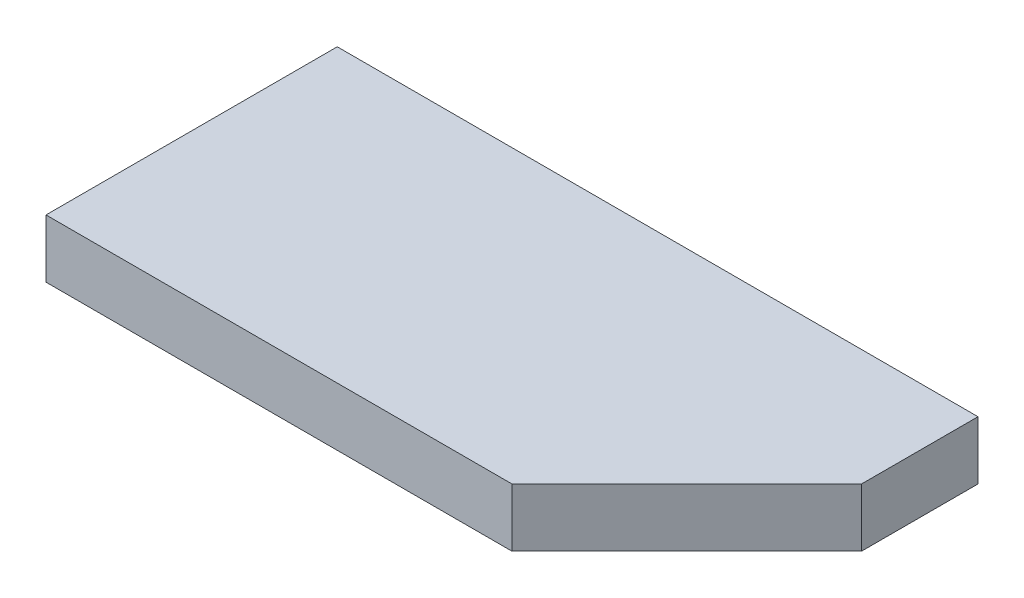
from build123d import *

# Parameters (mm, degrees)
EXTRUDE1_DEPTH = 5


with BuildPart() as part:
    # Sketch2 → Extrude1 (new body)
    with BuildSketch(Plane(origin=(0, 0, 0), x_dir=(1, 0, 0), z_dir=(0, 1, 0))):
        Polygon((0, 0), (40, 0), (55, 15), (55, 25), (0, 25), align=None)
    extrude(amount=EXTRUDE1_DEPTH)


solid = part.part
